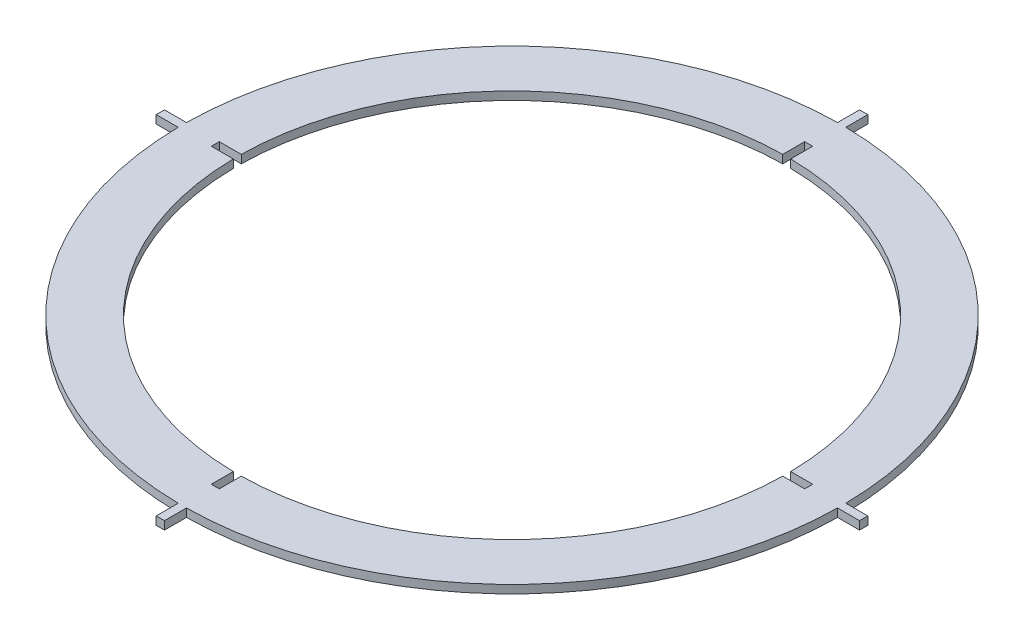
ISO-10303-21;
HEADER;
FILE_DESCRIPTION(('STEP AP214'),'2;1');
FILE_NAME('part.step','',(''),(''),'','','');
FILE_SCHEMA(('AUTOMOTIVE_DESIGN { 1 0 10303 214 1 1 1 1 }'));
ENDSEC;
DATA;
#1=APPLICATION_CONTEXT('core data for automotive mechanical design processes');
#2=APPLICATION_PROTOCOL_DEFINITION('international standard','automotive_design',2000,#1);
#3=PRODUCT_CONTEXT('',#1,'mechanical');
#4=PRODUCT('Part','Part','',(#3));
#5=PRODUCT_RELATED_PRODUCT_CATEGORY('part','',(#4));
#6=PRODUCT_DEFINITION_FORMATION('','',#4);
#7=PRODUCT_DEFINITION_CONTEXT('part definition',#1,'design');
#8=PRODUCT_DEFINITION('design','',#6,#7);
#9=PRODUCT_DEFINITION_SHAPE('','',#8);
#10=(LENGTH_UNIT() NAMED_UNIT(*) SI_UNIT(.MILLI.,.METRE.));
#11=(NAMED_UNIT(*) PLANE_ANGLE_UNIT() SI_UNIT($,.RADIAN.));
#12=(NAMED_UNIT(*) SI_UNIT($,.STERADIAN.) SOLID_ANGLE_UNIT());
#13=UNCERTAINTY_MEASURE_WITH_UNIT(LENGTH_MEASURE(1.E-05),#10,'distance_accuracy_value','');
#14=(GEOMETRIC_REPRESENTATION_CONTEXT(3) GLOBAL_UNCERTAINTY_ASSIGNED_CONTEXT((#13)) GLOBAL_UNIT_ASSIGNED_CONTEXT((#10,
#11,#12)) REPRESENTATION_CONTEXT('',''));
#15=CARTESIAN_POINT('',(0.,0.,0.));
#16=DIRECTION('',(0.,0.,1.));
#17=DIRECTION('',(1.,0.,0.));
#18=AXIS2_PLACEMENT_3D('',#15,#16,#17);
#19=CARTESIAN_POINT('',(0.,3.,-1.50000000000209));
#20=DIRECTION('',(0.,0.,1.));
#21=DIRECTION('',(1.,0.,0.));
#22=AXIS2_PLACEMENT_3D('',#19,#20,#21);
#23=PLANE('',#22);
#24=DIRECTION('',(-1.,0.,0.));
#25=VECTOR('',#24,1.);
#26=CARTESIAN_POINT('',(0.,0.,-1.50000000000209));
#27=LINE('',#26,#25);
#28=CARTESIAN_POINT('',(127.990624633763,0.,-1.50000000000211));
#29=VERTEX_POINT('',#28);
#30=CARTESIAN_POINT('',(119.990624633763,0.,-1.50000000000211));
#31=VERTEX_POINT('',#30);
#32=EDGE_CURVE('E326',#29,#31,#27,.T.);
#33=ORIENTED_EDGE('',*,*,#32,.T.);
#34=DIRECTION('',(0.,-1.,0.));
#35=VECTOR('',#34,1.);
#36=CARTESIAN_POINT('',(119.990624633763,3.,-1.50000000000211));
#37=LINE('',#36,#35);
#38=CARTESIAN_POINT('',(119.990624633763,3.,-1.50000000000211));
#39=VERTEX_POINT('',#38);
#40=EDGE_CURVE('E11',#39,#31,#37,.T.);
#41=ORIENTED_EDGE('',*,*,#40,.F.);
#42=DIRECTION('',(-1.,0.,0.));
#43=VECTOR('',#42,1.);
#44=CARTESIAN_POINT('',(0.,3.,-1.50000000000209));
#45=LINE('',#44,#43);
#46=CARTESIAN_POINT('',(127.990624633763,3.,-1.50000000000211));
#47=VERTEX_POINT('',#46);
#48=EDGE_CURVE('E484',#47,#39,#45,.T.);
#49=ORIENTED_EDGE('',*,*,#48,.F.);
#50=DIRECTION('',(0.,-1.,0.));
#51=VECTOR('',#50,1.);
#52=CARTESIAN_POINT('',(127.990624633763,3.,-1.50000000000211));
#53=LINE('',#52,#51);
#54=EDGE_CURVE('E54',#47,#29,#53,.T.);
#55=ORIENTED_EDGE('',*,*,#54,.T.);
#56=EDGE_LOOP('',(#33,#41,#49,#55));
#57=FACE_BOUND('',#56,.T.);
#58=ADVANCED_FACE('F35',(#57),#23,.F.);
#59=CARTESIAN_POINT('',(0.,3.,0.));
#60=DIRECTION('',(0.,-1.,0.));
#61=DIRECTION('',(0.,0.,-1.));
#62=AXIS2_PLACEMENT_3D('',#59,#60,#61);
#63=CYLINDRICAL_SURFACE('',#62,120.000000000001);
#64=CARTESIAN_POINT('',(0.,0.,0.));
#65=DIRECTION('',(0.,1.,0.));
#66=DIRECTION('',(0.,0.,1.));
#67=AXIS2_PLACEMENT_3D('',#64,#65,#66);
#68=CIRCLE('',#67,120.000000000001);
#69=CARTESIAN_POINT('',(1.50000000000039,0.,-119.99062463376));
#70=VERTEX_POINT('',#69);
#71=EDGE_CURVE('E328',#31,#70,#68,.T.);
#72=ORIENTED_EDGE('',*,*,#71,.T.);
#73=DIRECTION('',(0.,-1.,0.));
#74=VECTOR('',#73,1.);
#75=CARTESIAN_POINT('',(1.50000000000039,3.,-119.99062463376));
#76=LINE('',#75,#74);
#77=CARTESIAN_POINT('',(1.50000000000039,3.,-119.99062463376));
#78=VERTEX_POINT('',#77);
#79=EDGE_CURVE('E45',#78,#70,#76,.T.);
#80=ORIENTED_EDGE('',*,*,#79,.F.);
#81=CARTESIAN_POINT('',(0.,3.,0.));
#82=DIRECTION('',(0.,1.,0.));
#83=DIRECTION('',(0.,0.,1.));
#84=AXIS2_PLACEMENT_3D('',#81,#82,#83);
#85=CIRCLE('',#84,120.000000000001);
#86=EDGE_CURVE('E486',#39,#78,#85,.T.);
#87=ORIENTED_EDGE('',*,*,#86,.F.);
#88=ORIENTED_EDGE('',*,*,#40,.T.);
#89=EDGE_LOOP('',(#72,#80,#87,#88));
#90=FACE_BOUND('',#89,.T.);
#91=ADVANCED_FACE('F535',(#90),#63,.T.);
#92=CARTESIAN_POINT('',(1.49999999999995,3.,0.));
#93=DIRECTION('',(1.,0.,0.));
#94=DIRECTION('',(0.,0.,-1.));
#95=AXIS2_PLACEMENT_3D('',#92,#93,#94);
#96=PLANE('',#95);
#97=DIRECTION('',(0.,0.,1.));
#98=VECTOR('',#97,1.);
#99=CARTESIAN_POINT('',(1.49999999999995,0.,0.));
#100=LINE('',#99,#98);
#101=CARTESIAN_POINT('',(1.50000000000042,0.,-127.99062463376));
#102=VERTEX_POINT('',#101);
#103=EDGE_CURVE('E331',#102,#70,#100,.T.);
#104=ORIENTED_EDGE('',*,*,#103,.F.);
#105=DIRECTION('',(0.,-1.,0.));
#106=VECTOR('',#105,1.);
#107=CARTESIAN_POINT('',(1.50000000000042,3.,-127.99062463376));
#108=LINE('',#107,#106);
#109=CARTESIAN_POINT('',(1.50000000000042,3.,-127.99062463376));
#110=VERTEX_POINT('',#109);
#111=EDGE_CURVE('E391',#110,#102,#108,.T.);
#112=ORIENTED_EDGE('',*,*,#111,.F.);
#113=DIRECTION('',(0.,0.,1.));
#114=VECTOR('',#113,1.);
#115=CARTESIAN_POINT('',(1.49999999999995,3.,0.));
#116=LINE('',#115,#114);
#117=EDGE_CURVE('E488',#110,#78,#116,.T.);
#118=ORIENTED_EDGE('',*,*,#117,.T.);
#119=ORIENTED_EDGE('',*,*,#79,.T.);
#120=EDGE_LOOP('',(#104,#112,#118,#119));
#121=FACE_BOUND('',#120,.T.);
#122=ADVANCED_FACE('F540',(#121),#96,.T.);
#123=CARTESIAN_POINT('',(0.,3.,-127.99062463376));
#124=DIRECTION('',(0.,0.,-1.));
#125=DIRECTION('',(-1.,0.,0.));
#126=AXIS2_PLACEMENT_3D('',#123,#124,#125);
#127=PLANE('',#126);
#128=DIRECTION('',(1.,0.,0.));
#129=VECTOR('',#128,1.);
#130=CARTESIAN_POINT('',(0.,0.,-127.99062463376));
#131=LINE('',#130,#129);
#132=CARTESIAN_POINT('',(-1.49999999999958,0.,-127.99062463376));
#133=VERTEX_POINT('',#132);
#134=EDGE_CURVE('E334',#133,#102,#131,.T.);
#135=ORIENTED_EDGE('',*,*,#134,.F.);
#136=DIRECTION('',(0.,-1.,0.));
#137=VECTOR('',#136,1.);
#138=CARTESIAN_POINT('',(-1.49999999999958,3.,-127.99062463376));
#139=LINE('',#138,#137);
#140=CARTESIAN_POINT('',(-1.49999999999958,3.,-127.99062463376));
#141=VERTEX_POINT('',#140);
#142=EDGE_CURVE('E389',#141,#133,#139,.T.);
#143=ORIENTED_EDGE('',*,*,#142,.F.);
#144=DIRECTION('',(1.,0.,0.));
#145=VECTOR('',#144,1.);
#146=CARTESIAN_POINT('',(0.,3.,-127.99062463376));
#147=LINE('',#146,#145);
#148=EDGE_CURVE('E491',#141,#110,#147,.T.);
#149=ORIENTED_EDGE('',*,*,#148,.T.);
#150=ORIENTED_EDGE('',*,*,#111,.T.);
#151=EDGE_LOOP('',(#135,#143,#149,#150));
#152=FACE_BOUND('',#151,.T.);
#153=ADVANCED_FACE('F851',(#152),#127,.T.);
#154=CARTESIAN_POINT('',(-1.50000000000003,3.,0.));
#155=DIRECTION('',(1.,0.,0.));
#156=DIRECTION('',(0.,0.,-1.));
#157=AXIS2_PLACEMENT_3D('',#154,#155,#156);
#158=PLANE('',#157);
#159=DIRECTION('',(0.,0.,1.));
#160=VECTOR('',#159,1.);
#161=CARTESIAN_POINT('',(-1.50000000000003,0.,0.));
#162=LINE('',#161,#160);
#163=CARTESIAN_POINT('',(-1.49999999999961,0.,-119.99062463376));
#164=VERTEX_POINT('',#163);
#165=EDGE_CURVE('E337',#133,#164,#162,.T.);
#166=ORIENTED_EDGE('',*,*,#165,.T.);
#167=DIRECTION('',(0.,-1.,0.));
#168=VECTOR('',#167,1.);
#169=CARTESIAN_POINT('',(-1.49999999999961,3.,-119.99062463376));
#170=LINE('',#169,#168);
#171=CARTESIAN_POINT('',(-1.49999999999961,3.,-119.99062463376));
#172=VERTEX_POINT('',#171);
#173=EDGE_CURVE('E386',#172,#164,#170,.T.);
#174=ORIENTED_EDGE('',*,*,#173,.F.);
#175=DIRECTION('',(0.,0.,1.));
#176=VECTOR('',#175,1.);
#177=CARTESIAN_POINT('',(-1.50000000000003,3.,0.));
#178=LINE('',#177,#176);
#179=EDGE_CURVE('E494',#141,#172,#178,.T.);
#180=ORIENTED_EDGE('',*,*,#179,.F.);
#181=ORIENTED_EDGE('',*,*,#142,.T.);
#182=EDGE_LOOP('',(#166,#174,#180,#181));
#183=FACE_BOUND('',#182,.T.);
#184=ADVANCED_FACE('F841',(#183),#158,.F.);
#185=CARTESIAN_POINT('',(0.,3.,0.));
#186=DIRECTION('',(0.,-1.,0.));
#187=DIRECTION('',(0.,0.,-1.));
#188=AXIS2_PLACEMENT_3D('',#185,#186,#187);
#189=CYLINDRICAL_SURFACE('',#188,120.);
#190=CARTESIAN_POINT('',(0.,0.,0.));
#191=DIRECTION('',(0.,1.,0.));
#192=DIRECTION('',(0.,0.,1.));
#193=AXIS2_PLACEMENT_3D('',#190,#191,#192);
#194=CIRCLE('',#193,120.);
#195=CARTESIAN_POINT('',(-119.99062463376,0.,-1.49999999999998));
#196=VERTEX_POINT('',#195);
#197=EDGE_CURVE('E339',#164,#196,#194,.T.);
#198=ORIENTED_EDGE('',*,*,#197,.T.);
#199=DIRECTION('',(0.,-1.,0.));
#200=VECTOR('',#199,1.);
#201=CARTESIAN_POINT('',(-119.99062463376,3.,-1.49999999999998));
#202=LINE('',#201,#200);
#203=CARTESIAN_POINT('',(-119.99062463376,3.,-1.49999999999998));
#204=VERTEX_POINT('',#203);
#205=EDGE_CURVE('E384',#204,#196,#202,.T.);
#206=ORIENTED_EDGE('',*,*,#205,.F.);
#207=CARTESIAN_POINT('',(0.,3.,0.));
#208=DIRECTION('',(0.,1.,0.));
#209=DIRECTION('',(0.,0.,1.));
#210=AXIS2_PLACEMENT_3D('',#207,#208,#209);
#211=CIRCLE('',#210,120.);
#212=EDGE_CURVE('E496',#172,#204,#211,.T.);
#213=ORIENTED_EDGE('',*,*,#212,.F.);
#214=ORIENTED_EDGE('',*,*,#173,.T.);
#215=EDGE_LOOP('',(#198,#206,#213,#214));
#216=FACE_BOUND('',#215,.T.);
#217=ADVANCED_FACE('F831',(#216),#189,.T.);
#218=CARTESIAN_POINT('',(0.,3.,-1.49999999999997));
#219=DIRECTION('',(0.,0.,-1.));
#220=DIRECTION('',(-1.,0.,0.));
#221=AXIS2_PLACEMENT_3D('',#218,#219,#220);
#222=PLANE('',#221);
#223=DIRECTION('',(1.,0.,0.));
#224=VECTOR('',#223,1.);
#225=CARTESIAN_POINT('',(0.,0.,-1.49999999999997));
#226=LINE('',#225,#224);
#227=CARTESIAN_POINT('',(-127.99062463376,0.,-1.49999999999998));
#228=VERTEX_POINT('',#227);
#229=EDGE_CURVE('E342',#228,#196,#226,.T.);
#230=ORIENTED_EDGE('',*,*,#229,.F.);
#231=DIRECTION('',(0.,-1.,0.));
#232=VECTOR('',#231,1.);
#233=CARTESIAN_POINT('',(-127.99062463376,3.,-1.49999999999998));
#234=LINE('',#233,#232);
#235=CARTESIAN_POINT('',(-127.99062463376,3.,-1.49999999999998));
#236=VERTEX_POINT('',#235);
#237=EDGE_CURVE('E382',#236,#228,#234,.T.);
#238=ORIENTED_EDGE('',*,*,#237,.F.);
#239=DIRECTION('',(1.,0.,0.));
#240=VECTOR('',#239,1.);
#241=CARTESIAN_POINT('',(0.,3.,-1.49999999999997));
#242=LINE('',#241,#240);
#243=EDGE_CURVE('E498',#236,#204,#242,.T.);
#244=ORIENTED_EDGE('',*,*,#243,.T.);
#245=ORIENTED_EDGE('',*,*,#205,.T.);
#246=EDGE_LOOP('',(#230,#238,#244,#245));
#247=FACE_BOUND('',#246,.T.);
#248=ADVANCED_FACE('F821',(#247),#222,.T.);
#249=CARTESIAN_POINT('',(-127.99062463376,3.,0.));
#250=DIRECTION('',(-1.,0.,0.));
#251=DIRECTION('',(0.,0.,1.));
#252=AXIS2_PLACEMENT_3D('',#249,#250,#251);
#253=PLANE('',#252);
#254=DIRECTION('',(0.,0.,-1.));
#255=VECTOR('',#254,1.);
#256=CARTESIAN_POINT('',(-127.99062463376,0.,0.));
#257=LINE('',#256,#255);
#258=CARTESIAN_POINT('',(-127.99062463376,0.,1.50000000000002));
#259=VERTEX_POINT('',#258);
#260=EDGE_CURVE('E345',#259,#228,#257,.T.);
#261=ORIENTED_EDGE('',*,*,#260,.F.);
#262=DIRECTION('',(0.,-1.,0.));
#263=VECTOR('',#262,1.);
#264=CARTESIAN_POINT('',(-127.99062463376,3.,1.50000000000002));
#265=LINE('',#264,#263);
#266=CARTESIAN_POINT('',(-127.99062463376,3.,1.50000000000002));
#267=VERTEX_POINT('',#266);
#268=EDGE_CURVE('E380',#267,#259,#265,.T.);
#269=ORIENTED_EDGE('',*,*,#268,.F.);
#270=DIRECTION('',(0.,0.,-1.));
#271=VECTOR('',#270,1.);
#272=CARTESIAN_POINT('',(-127.99062463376,3.,0.));
#273=LINE('',#272,#271);
#274=EDGE_CURVE('E501',#267,#236,#273,.T.);
#275=ORIENTED_EDGE('',*,*,#274,.T.);
#276=ORIENTED_EDGE('',*,*,#237,.T.);
#277=EDGE_LOOP('',(#261,#269,#275,#276));
#278=FACE_BOUND('',#277,.T.);
#279=ADVANCED_FACE('F811',(#278),#253,.T.);
#280=CARTESIAN_POINT('',(0.,3.,1.50000000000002));
#281=DIRECTION('',(0.,0.,-1.));
#282=DIRECTION('',(-1.,0.,0.));
#283=AXIS2_PLACEMENT_3D('',#280,#281,#282);
#284=PLANE('',#283);
#285=DIRECTION('',(1.,0.,0.));
#286=VECTOR('',#285,1.);
#287=CARTESIAN_POINT('',(0.,0.,1.50000000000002));
#288=LINE('',#287,#286);
#289=CARTESIAN_POINT('',(-119.99062463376,0.,1.50000000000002));
#290=VERTEX_POINT('',#289);
#291=EDGE_CURVE('E348',#259,#290,#288,.T.);
#292=ORIENTED_EDGE('',*,*,#291,.T.);
#293=DIRECTION('',(0.,-1.,0.));
#294=VECTOR('',#293,1.);
#295=CARTESIAN_POINT('',(-119.99062463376,3.,1.50000000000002));
#296=LINE('',#295,#294);
#297=CARTESIAN_POINT('',(-119.99062463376,3.,1.50000000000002));
#298=VERTEX_POINT('',#297);
#299=EDGE_CURVE('E377',#298,#290,#296,.T.);
#300=ORIENTED_EDGE('',*,*,#299,.F.);
#301=DIRECTION('',(1.,0.,0.));
#302=VECTOR('',#301,1.);
#303=CARTESIAN_POINT('',(0.,3.,1.50000000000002));
#304=LINE('',#303,#302);
#305=EDGE_CURVE('E504',#267,#298,#304,.T.);
#306=ORIENTED_EDGE('',*,*,#305,.F.);
#307=ORIENTED_EDGE('',*,*,#268,.T.);
#308=EDGE_LOOP('',(#292,#300,#306,#307));
#309=FACE_BOUND('',#308,.T.);
#310=ADVANCED_FACE('F801',(#309),#284,.F.);
#311=CARTESIAN_POINT('',(0.,3.,0.));
#312=DIRECTION('',(0.,-1.,0.));
#313=DIRECTION('',(0.,0.,-1.));
#314=AXIS2_PLACEMENT_3D('',#311,#312,#313);
#315=CYLINDRICAL_SURFACE('',#314,120.);
#316=CARTESIAN_POINT('',(0.,0.,0.));
#317=DIRECTION('',(0.,1.,0.));
#318=DIRECTION('',(0.,0.,1.));
#319=AXIS2_PLACEMENT_3D('',#316,#317,#318);
#320=CIRCLE('',#319,120.);
#321=CARTESIAN_POINT('',(-1.49999999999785,0.,119.99062463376));
#322=VERTEX_POINT('',#321);
#323=EDGE_CURVE('E350',#290,#322,#320,.T.);
#324=ORIENTED_EDGE('',*,*,#323,.T.);
#325=DIRECTION('',(0.,-1.,0.));
#326=VECTOR('',#325,1.);
#327=CARTESIAN_POINT('',(-1.49999999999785,3.,119.99062463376));
#328=LINE('',#327,#326);
#329=CARTESIAN_POINT('',(-1.49999999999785,3.,119.99062463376));
#330=VERTEX_POINT('',#329);
#331=EDGE_CURVE('E375',#330,#322,#328,.T.);
#332=ORIENTED_EDGE('',*,*,#331,.F.);
#333=CARTESIAN_POINT('',(0.,3.,0.));
#334=DIRECTION('',(0.,1.,0.));
#335=DIRECTION('',(0.,0.,1.));
#336=AXIS2_PLACEMENT_3D('',#333,#334,#335);
#337=CIRCLE('',#336,120.);
#338=EDGE_CURVE('E506',#298,#330,#337,.T.);
#339=ORIENTED_EDGE('',*,*,#338,.F.);
#340=ORIENTED_EDGE('',*,*,#299,.T.);
#341=EDGE_LOOP('',(#324,#332,#339,#340));
#342=FACE_BOUND('',#341,.T.);
#343=ADVANCED_FACE('F791',(#342),#315,.T.);
#344=CARTESIAN_POINT('',(-1.49999999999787,3.,0.));
#345=DIRECTION('',(-1.,0.,0.));
#346=DIRECTION('',(0.,0.,1.));
#347=AXIS2_PLACEMENT_3D('',#344,#345,#346);
#348=PLANE('',#347);
#349=DIRECTION('',(0.,0.,-1.));
#350=VECTOR('',#349,1.);
#351=CARTESIAN_POINT('',(-1.49999999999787,0.,0.));
#352=LINE('',#351,#350);
#353=CARTESIAN_POINT('',(-1.49999999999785,0.,127.99062463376));
#354=VERTEX_POINT('',#353);
#355=EDGE_CURVE('E353',#354,#322,#352,.T.);
#356=ORIENTED_EDGE('',*,*,#355,.F.);
#357=DIRECTION('',(0.,-1.,0.));
#358=VECTOR('',#357,1.);
#359=CARTESIAN_POINT('',(-1.49999999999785,3.,127.99062463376));
#360=LINE('',#359,#358);
#361=CARTESIAN_POINT('',(-1.49999999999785,3.,127.99062463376));
#362=VERTEX_POINT('',#361);
#363=EDGE_CURVE('E373',#362,#354,#360,.T.);
#364=ORIENTED_EDGE('',*,*,#363,.F.);
#365=DIRECTION('',(0.,0.,-1.));
#366=VECTOR('',#365,1.);
#367=CARTESIAN_POINT('',(-1.49999999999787,3.,0.));
#368=LINE('',#367,#366);
#369=EDGE_CURVE('E508',#362,#330,#368,.T.);
#370=ORIENTED_EDGE('',*,*,#369,.T.);
#371=ORIENTED_EDGE('',*,*,#331,.T.);
#372=EDGE_LOOP('',(#356,#364,#370,#371));
#373=FACE_BOUND('',#372,.T.);
#374=ADVANCED_FACE('F521',(#373),#348,.T.);
#375=CARTESIAN_POINT('',(-1.18415115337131E-12,3.,127.99062463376));
#376=DIRECTION('',(0.,0.,1.));
#377=DIRECTION('',(1.,0.,0.));
#378=AXIS2_PLACEMENT_3D('',#375,#376,#377);
#379=PLANE('',#378);
#380=DIRECTION('',(-1.,0.,0.));
#381=VECTOR('',#380,1.);
#382=CARTESIAN_POINT('',(-1.18415115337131E-12,0.,127.99062463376));
#383=LINE('',#382,#381);
#384=CARTESIAN_POINT('',(1.50000000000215,0.,127.99062463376));
#385=VERTEX_POINT('',#384);
#386=EDGE_CURVE('E356',#385,#354,#383,.T.);
#387=ORIENTED_EDGE('',*,*,#386,.F.);
#388=DIRECTION('',(0.,-1.,0.));
#389=VECTOR('',#388,1.);
#390=CARTESIAN_POINT('',(1.50000000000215,3.,127.99062463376));
#391=LINE('',#390,#389);
#392=CARTESIAN_POINT('',(1.50000000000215,3.,127.99062463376));
#393=VERTEX_POINT('',#392);
#394=EDGE_CURVE('E371',#393,#385,#391,.T.);
#395=ORIENTED_EDGE('',*,*,#394,.F.);
#396=DIRECTION('',(-1.,0.,0.));
#397=VECTOR('',#396,1.);
#398=CARTESIAN_POINT('',(-1.18415115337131E-12,3.,127.99062463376));
#399=LINE('',#398,#397);
#400=EDGE_CURVE('E511',#393,#362,#399,.T.);
#401=ORIENTED_EDGE('',*,*,#400,.T.);
#402=ORIENTED_EDGE('',*,*,#363,.T.);
#403=EDGE_LOOP('',(#387,#395,#401,#402));
#404=FACE_BOUND('',#403,.T.);
#405=ADVANCED_FACE('F515',(#404),#379,.T.);
#406=CARTESIAN_POINT('',(1.50000000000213,3.,0.));
#407=DIRECTION('',(-1.,0.,0.));
#408=DIRECTION('',(0.,0.,1.));
#409=AXIS2_PLACEMENT_3D('',#406,#407,#408);
#410=PLANE('',#409);
#411=DIRECTION('',(0.,0.,-1.));
#412=VECTOR('',#411,1.);
#413=CARTESIAN_POINT('',(1.50000000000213,0.,0.));
#414=LINE('',#413,#412);
#415=CARTESIAN_POINT('',(1.50000000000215,0.,119.99062463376));
#416=VERTEX_POINT('',#415);
#417=EDGE_CURVE('E359',#385,#416,#414,.T.);
#418=ORIENTED_EDGE('',*,*,#417,.T.);
#419=DIRECTION('',(0.,-1.,0.));
#420=VECTOR('',#419,1.);
#421=CARTESIAN_POINT('',(1.50000000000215,3.,119.99062463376));
#422=LINE('',#421,#420);
#423=CARTESIAN_POINT('',(1.50000000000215,3.,119.99062463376));
#424=VERTEX_POINT('',#423);
#425=EDGE_CURVE('E273',#424,#416,#422,.T.);
#426=ORIENTED_EDGE('',*,*,#425,.F.);
#427=DIRECTION('',(0.,0.,-1.));
#428=VECTOR('',#427,1.);
#429=CARTESIAN_POINT('',(1.50000000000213,3.,0.));
#430=LINE('',#429,#428);
#431=EDGE_CURVE('E261',#393,#424,#430,.T.);
#432=ORIENTED_EDGE('',*,*,#431,.F.);
#433=ORIENTED_EDGE('',*,*,#394,.T.);
#434=EDGE_LOOP('',(#418,#426,#432,#433));
#435=FACE_BOUND('',#434,.T.);
#436=ADVANCED_FACE('F525',(#435),#410,.F.);
#437=CARTESIAN_POINT('',(0.,3.,0.));
#438=DIRECTION('',(0.,-1.,0.));
#439=DIRECTION('',(0.,0.,-1.));
#440=AXIS2_PLACEMENT_3D('',#437,#438,#439);
#441=CYLINDRICAL_SURFACE('',#440,120.000000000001);
#442=CARTESIAN_POINT('',(0.,0.,0.));
#443=DIRECTION('',(0.,1.,0.));
#444=DIRECTION('',(0.,0.,1.));
#445=AXIS2_PLACEMENT_3D('',#442,#443,#444);
#446=CIRCLE('',#445,120.000000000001);
#447=CARTESIAN_POINT('',(119.990624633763,0.,1.4999999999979));
#448=VERTEX_POINT('',#447);
#449=EDGE_CURVE('E270',#416,#448,#446,.T.);
#450=ORIENTED_EDGE('',*,*,#449,.T.);
#451=DIRECTION('',(0.,-1.,0.));
#452=VECTOR('',#451,1.);
#453=CARTESIAN_POINT('',(119.990624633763,3.,1.4999999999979));
#454=LINE('',#453,#452);
#455=CARTESIAN_POINT('',(119.990624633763,3.,1.4999999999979));
#456=VERTEX_POINT('',#455);
#457=EDGE_CURVE('E267',#456,#448,#454,.T.);
#458=ORIENTED_EDGE('',*,*,#457,.F.);
#459=CARTESIAN_POINT('',(0.,3.,0.));
#460=DIRECTION('',(0.,1.,0.));
#461=DIRECTION('',(0.,0.,1.));
#462=AXIS2_PLACEMENT_3D('',#459,#460,#461);
#463=CIRCLE('',#462,120.000000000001);
#464=EDGE_CURVE('E252',#424,#456,#463,.T.);
#465=ORIENTED_EDGE('',*,*,#464,.F.);
#466=ORIENTED_EDGE('',*,*,#425,.T.);
#467=EDGE_LOOP('',(#450,#458,#465,#466));
#468=FACE_BOUND('',#467,.T.);
#469=ADVANCED_FACE('F268',(#468),#441,.T.);
#470=CARTESIAN_POINT('',(0.,3.,1.49999999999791));
#471=DIRECTION('',(0.,0.,1.));
#472=DIRECTION('',(1.,0.,0.));
#473=AXIS2_PLACEMENT_3D('',#470,#471,#472);
#474=PLANE('',#473);
#475=DIRECTION('',(-1.,0.,0.));
#476=VECTOR('',#475,1.);
#477=CARTESIAN_POINT('',(0.,0.,1.49999999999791));
#478=LINE('',#477,#476);
#479=CARTESIAN_POINT('',(127.990624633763,0.,1.49999999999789));
#480=VERTEX_POINT('',#479);
#481=EDGE_CURVE('E362',#480,#448,#478,.T.);
#482=ORIENTED_EDGE('',*,*,#481,.F.);
#483=DIRECTION('',(0.,-1.,0.));
#484=VECTOR('',#483,1.);
#485=CARTESIAN_POINT('',(127.990624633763,3.,1.49999999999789));
#486=LINE('',#485,#484);
#487=CARTESIAN_POINT('',(127.990624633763,3.,1.49999999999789));
#488=VERTEX_POINT('',#487);
#489=EDGE_CURVE('E152',#488,#480,#486,.T.);
#490=ORIENTED_EDGE('',*,*,#489,.F.);
#491=DIRECTION('',(-1.,0.,0.));
#492=VECTOR('',#491,1.);
#493=CARTESIAN_POINT('',(0.,3.,1.49999999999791));
#494=LINE('',#493,#492);
#495=EDGE_CURVE('E258',#488,#456,#494,.T.);
#496=ORIENTED_EDGE('',*,*,#495,.T.);
#497=ORIENTED_EDGE('',*,*,#457,.T.);
#498=EDGE_LOOP('',(#482,#490,#496,#497));
#499=FACE_BOUND('',#498,.T.);
#500=ADVANCED_FACE('F275',(#499),#474,.T.);
#501=CARTESIAN_POINT('',(0.,3.,0.));
#502=DIRECTION('',(0.,-1.,0.));
#503=DIRECTION('',(0.,0.,-1.));
#504=AXIS2_PLACEMENT_3D('',#501,#502,#503);
#505=CYLINDRICAL_SURFACE('',#504,100.);
#506=CARTESIAN_POINT('',(0.,0.,0.));
#507=DIRECTION('',(0.,1.,0.));
#508=DIRECTION('',(0.,0.,1.));
#509=AXIS2_PLACEMENT_3D('',#506,#507,#508);
#510=CIRCLE('',#509,100.);
#511=CARTESIAN_POINT('',(99.9894869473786,0.,-1.45));
#512=VERTEX_POINT('',#511);
#513=CARTESIAN_POINT('',(1.45,0.,-99.9894869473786));
#514=VERTEX_POINT('',#513);
#515=EDGE_CURVE('E282',#512,#514,#510,.T.);
#516=ORIENTED_EDGE('',*,*,#515,.F.);
#517=DIRECTION('',(0.,-1.,0.));
#518=VECTOR('',#517,1.);
#519=CARTESIAN_POINT('',(99.9894869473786,3.,-1.45));
#520=LINE('',#519,#518);
#521=CARTESIAN_POINT('',(99.9894869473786,3.,-1.45));
#522=VERTEX_POINT('',#521);
#523=EDGE_CURVE('E39',#522,#512,#520,.T.);
#524=ORIENTED_EDGE('',*,*,#523,.F.);
#525=CARTESIAN_POINT('',(0.,3.,0.));
#526=DIRECTION('',(0.,1.,0.));
#527=DIRECTION('',(0.,0.,1.));
#528=AXIS2_PLACEMENT_3D('',#525,#526,#527);
#529=CIRCLE('',#528,100.);
#530=CARTESIAN_POINT('',(1.45,3.,-99.9894869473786));
#531=VERTEX_POINT('',#530);
#532=EDGE_CURVE('E367',#522,#531,#529,.T.);
#533=ORIENTED_EDGE('',*,*,#532,.T.);
#534=DIRECTION('',(0.,-1.,0.));
#535=VECTOR('',#534,1.);
#536=CARTESIAN_POINT('',(1.45,3.,-99.9894869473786));
#537=LINE('',#536,#535);
#538=EDGE_CURVE('E278',#531,#514,#537,.T.);
#539=ORIENTED_EDGE('',*,*,#538,.T.);
#540=EDGE_LOOP('',(#516,#524,#533,#539));
#541=FACE_BOUND('',#540,.T.);
#542=ADVANCED_FACE('F37',(#541),#505,.F.);
#543=CARTESIAN_POINT('',(0.,3.,-1.44999999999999));
#544=DIRECTION('',(0.,0.,1.));
#545=DIRECTION('',(1.,0.,0.));
#546=AXIS2_PLACEMENT_3D('',#543,#544,#545);
#547=PLANE('',#546);
#548=DIRECTION('',(-1.,0.,0.));
#549=VECTOR('',#548,1.);
#550=CARTESIAN_POINT('',(0.,0.,-1.44999999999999));
#551=LINE('',#550,#549);
#552=CARTESIAN_POINT('',(107.989486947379,0.,-1.45));
#553=VERTEX_POINT('',#552);
#554=EDGE_CURVE('E285',#553,#512,#551,.T.);
#555=ORIENTED_EDGE('',*,*,#554,.F.);
#556=DIRECTION('',(0.,-1.,0.));
#557=VECTOR('',#556,1.);
#558=CARTESIAN_POINT('',(107.989486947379,3.,-1.45));
#559=LINE('',#558,#557);
#560=CARTESIAN_POINT('',(107.989486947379,3.,-1.45));
#561=VERTEX_POINT('',#560);
#562=EDGE_CURVE('E424',#561,#553,#559,.T.);
#563=ORIENTED_EDGE('',*,*,#562,.F.);
#564=DIRECTION('',(-1.,0.,0.));
#565=VECTOR('',#564,1.);
#566=CARTESIAN_POINT('',(0.,3.,-1.44999999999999));
#567=LINE('',#566,#565);
#568=EDGE_CURVE('E433',#561,#522,#567,.T.);
#569=ORIENTED_EDGE('',*,*,#568,.T.);
#570=ORIENTED_EDGE('',*,*,#523,.T.);
#571=EDGE_LOOP('',(#555,#563,#569,#570));
#572=FACE_BOUND('',#571,.T.);
#573=ADVANCED_FACE('F431',(#572),#547,.T.);
#574=CARTESIAN_POINT('',(107.989486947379,3.,5.16777650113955E-13));
#575=DIRECTION('',(1.,0.,0.));
#576=DIRECTION('',(0.,0.,-1.));
#577=AXIS2_PLACEMENT_3D('',#574,#575,#576);
#578=PLANE('',#577);
#579=DIRECTION('',(0.,0.,1.));
#580=VECTOR('',#579,1.);
#581=CARTESIAN_POINT('',(107.989486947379,0.,5.16777650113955E-13));
#582=LINE('',#581,#580);
#583=CARTESIAN_POINT('',(107.989486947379,0.,1.45));
#584=VERTEX_POINT('',#583);
#585=EDGE_CURVE('E288',#553,#584,#582,.T.);
#586=ORIENTED_EDGE('',*,*,#585,.T.);
#587=DIRECTION('',(0.,-1.,0.));
#588=VECTOR('',#587,1.);
#589=CARTESIAN_POINT('',(107.989486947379,3.,1.45));
#590=LINE('',#589,#588);
#591=CARTESIAN_POINT('',(107.989486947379,3.,1.45));
#592=VERTEX_POINT('',#591);
#593=EDGE_CURVE('E422',#592,#584,#590,.T.);
#594=ORIENTED_EDGE('',*,*,#593,.F.);
#595=DIRECTION('',(0.,0.,1.));
#596=VECTOR('',#595,1.);
#597=CARTESIAN_POINT('',(107.989486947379,3.,5.16777650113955E-13));
#598=LINE('',#597,#596);
#599=EDGE_CURVE('E451',#561,#592,#598,.T.);
#600=ORIENTED_EDGE('',*,*,#599,.F.);
#601=ORIENTED_EDGE('',*,*,#562,.T.);
#602=EDGE_LOOP('',(#586,#594,#600,#601));
#603=FACE_BOUND('',#602,.T.);
#604=ADVANCED_FACE('F441',(#603),#578,.F.);
#605=CARTESIAN_POINT('',(0.,3.,1.44999999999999));
#606=DIRECTION('',(0.,0.,1.));
#607=DIRECTION('',(1.,0.,0.));
#608=AXIS2_PLACEMENT_3D('',#605,#606,#607);
#609=PLANE('',#608);
#610=DIRECTION('',(-1.,0.,0.));
#611=VECTOR('',#610,1.);
#612=CARTESIAN_POINT('',(0.,0.,1.44999999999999));
#613=LINE('',#612,#611);
#614=CARTESIAN_POINT('',(99.9894869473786,0.,1.45));
#615=VERTEX_POINT('',#614);
#616=EDGE_CURVE('E290',#584,#615,#613,.T.);
#617=ORIENTED_EDGE('',*,*,#616,.T.);
#618=DIRECTION('',(0.,-1.,0.));
#619=VECTOR('',#618,1.);
#620=CARTESIAN_POINT('',(99.9894869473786,3.,1.45));
#621=LINE('',#620,#619);
#622=CARTESIAN_POINT('',(99.9894869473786,3.,1.45));
#623=VERTEX_POINT('',#622);
#624=EDGE_CURVE('E420',#623,#615,#621,.T.);
#625=ORIENTED_EDGE('',*,*,#624,.F.);
#626=DIRECTION('',(-1.,0.,0.));
#627=VECTOR('',#626,1.);
#628=CARTESIAN_POINT('',(0.,3.,1.44999999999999));
#629=LINE('',#628,#627);
#630=EDGE_CURVE('E446',#592,#623,#629,.T.);
#631=ORIENTED_EDGE('',*,*,#630,.F.);
#632=ORIENTED_EDGE('',*,*,#593,.T.);
#633=EDGE_LOOP('',(#617,#625,#631,#632));
#634=FACE_BOUND('',#633,.T.);
#635=ADVANCED_FACE('F444',(#634),#609,.F.);
#636=CARTESIAN_POINT('',(0.,3.,0.));
#637=DIRECTION('',(0.,-1.,0.));
#638=DIRECTION('',(0.,0.,-1.));
#639=AXIS2_PLACEMENT_3D('',#636,#637,#638);
#640=CYLINDRICAL_SURFACE('',#639,100.);
#641=CARTESIAN_POINT('',(0.,0.,0.));
#642=DIRECTION('',(0.,1.,0.));
#643=DIRECTION('',(0.,0.,1.));
#644=AXIS2_PLACEMENT_3D('',#641,#642,#643);
#645=CIRCLE('',#644,100.);
#646=CARTESIAN_POINT('',(1.45,0.,99.9894869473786));
#647=VERTEX_POINT('',#646);
#648=EDGE_CURVE('E293',#647,#615,#645,.T.);
#649=ORIENTED_EDGE('',*,*,#648,.F.);
#650=DIRECTION('',(0.,-1.,0.));
#651=VECTOR('',#650,1.);
#652=CARTESIAN_POINT('',(1.45,3.,99.9894869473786));
#653=LINE('',#652,#651);
#654=CARTESIAN_POINT('',(1.45,3.,99.9894869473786));
#655=VERTEX_POINT('',#654);
#656=EDGE_CURVE('E418',#655,#647,#653,.T.);
#657=ORIENTED_EDGE('',*,*,#656,.F.);
#658=CARTESIAN_POINT('',(0.,3.,0.));
#659=DIRECTION('',(0.,1.,0.));
#660=DIRECTION('',(0.,0.,1.));
#661=AXIS2_PLACEMENT_3D('',#658,#659,#660);
#662=CIRCLE('',#661,100.);
#663=EDGE_CURVE('E450',#655,#623,#662,.T.);
#664=ORIENTED_EDGE('',*,*,#663,.T.);
#665=ORIENTED_EDGE('',*,*,#624,.T.);
#666=EDGE_LOOP('',(#649,#657,#664,#665));
#667=FACE_BOUND('',#666,.T.);
#668=ADVANCED_FACE('F589',(#667),#640,.F.);
#669=CARTESIAN_POINT('',(1.44999999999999,3.,0.));
#670=DIRECTION('',(-1.,0.,0.));
#671=DIRECTION('',(0.,0.,1.));
#672=AXIS2_PLACEMENT_3D('',#669,#670,#671);
#673=PLANE('',#672);
#674=DIRECTION('',(0.,0.,-1.));
#675=VECTOR('',#674,1.);
#676=CARTESIAN_POINT('',(1.44999999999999,0.,0.));
#677=LINE('',#676,#675);
#678=CARTESIAN_POINT('',(1.45000000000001,0.,107.989486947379));
#679=VERTEX_POINT('',#678);
#680=EDGE_CURVE('E296',#679,#647,#677,.T.);
#681=ORIENTED_EDGE('',*,*,#680,.F.);
#682=DIRECTION('',(0.,-1.,0.));
#683=VECTOR('',#682,1.);
#684=CARTESIAN_POINT('',(1.45000000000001,3.,107.989486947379));
#685=LINE('',#684,#683);
#686=CARTESIAN_POINT('',(1.45000000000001,3.,107.989486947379));
#687=VERTEX_POINT('',#686);
#688=EDGE_CURVE('E416',#687,#679,#685,.T.);
#689=ORIENTED_EDGE('',*,*,#688,.F.);
#690=DIRECTION('',(0.,0.,-1.));
#691=VECTOR('',#690,1.);
#692=CARTESIAN_POINT('',(1.44999999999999,3.,0.));
#693=LINE('',#692,#691);
#694=EDGE_CURVE('E453',#687,#655,#693,.T.);
#695=ORIENTED_EDGE('',*,*,#694,.T.);
#696=ORIENTED_EDGE('',*,*,#656,.T.);
#697=EDGE_LOOP('',(#681,#689,#695,#696));
#698=FACE_BOUND('',#697,.T.);
#699=ADVANCED_FACE('F585',(#698),#673,.T.);
#700=CARTESIAN_POINT('',(-5.16777650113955E-13,3.,107.989486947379));
#701=DIRECTION('',(0.,0.,1.));
#702=DIRECTION('',(1.,0.,0.));
#703=AXIS2_PLACEMENT_3D('',#700,#701,#702);
#704=PLANE('',#703);
#705=DIRECTION('',(-1.,0.,0.));
#706=VECTOR('',#705,1.);
#707=CARTESIAN_POINT('',(-5.16777650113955E-13,0.,107.989486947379));
#708=LINE('',#707,#706);
#709=CARTESIAN_POINT('',(-1.44999999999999,0.,107.989486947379));
#710=VERTEX_POINT('',#709);
#711=EDGE_CURVE('E299',#679,#710,#708,.T.);
#712=ORIENTED_EDGE('',*,*,#711,.T.);
#713=DIRECTION('',(0.,-1.,0.));
#714=VECTOR('',#713,1.);
#715=CARTESIAN_POINT('',(-1.44999999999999,3.,107.989486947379));
#716=LINE('',#715,#714);
#717=CARTESIAN_POINT('',(-1.44999999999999,3.,107.989486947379));
#718=VERTEX_POINT('',#717);
#719=EDGE_CURVE('E413',#718,#710,#716,.T.);
#720=ORIENTED_EDGE('',*,*,#719,.F.);
#721=DIRECTION('',(-1.,0.,0.));
#722=VECTOR('',#721,1.);
#723=CARTESIAN_POINT('',(-5.16777650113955E-13,3.,107.989486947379));
#724=LINE('',#723,#722);
#725=EDGE_CURVE('E460',#687,#718,#724,.T.);
#726=ORIENTED_EDGE('',*,*,#725,.F.);
#727=ORIENTED_EDGE('',*,*,#688,.T.);
#728=EDGE_LOOP('',(#712,#720,#726,#727));
#729=FACE_BOUND('',#728,.T.);
#730=ADVANCED_FACE('F581',(#729),#704,.F.);
#731=CARTESIAN_POINT('',(-1.44999999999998,3.,0.));
#732=DIRECTION('',(-1.,0.,0.));
#733=DIRECTION('',(0.,0.,1.));
#734=AXIS2_PLACEMENT_3D('',#731,#732,#733);
#735=PLANE('',#734);
#736=DIRECTION('',(0.,0.,-1.));
#737=VECTOR('',#736,1.);
#738=CARTESIAN_POINT('',(-1.44999999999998,0.,0.));
#739=LINE('',#738,#737);
#740=CARTESIAN_POINT('',(-1.44999999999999,0.,99.9894869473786));
#741=VERTEX_POINT('',#740);
#742=EDGE_CURVE('E301',#710,#741,#739,.T.);
#743=ORIENTED_EDGE('',*,*,#742,.T.);
#744=DIRECTION('',(0.,-1.,0.));
#745=VECTOR('',#744,1.);
#746=CARTESIAN_POINT('',(-1.44999999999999,3.,99.9894869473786));
#747=LINE('',#746,#745);
#748=CARTESIAN_POINT('',(-1.44999999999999,3.,99.9894869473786));
#749=VERTEX_POINT('',#748);
#750=EDGE_CURVE('E411',#749,#741,#747,.T.);
#751=ORIENTED_EDGE('',*,*,#750,.F.);
#752=DIRECTION('',(0.,0.,-1.));
#753=VECTOR('',#752,1.);
#754=CARTESIAN_POINT('',(-1.44999999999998,3.,0.));
#755=LINE('',#754,#753);
#756=EDGE_CURVE('E462',#718,#749,#755,.T.);
#757=ORIENTED_EDGE('',*,*,#756,.F.);
#758=ORIENTED_EDGE('',*,*,#719,.T.);
#759=EDGE_LOOP('',(#743,#751,#757,#758));
#760=FACE_BOUND('',#759,.T.);
#761=ADVANCED_FACE('F577',(#760),#735,.F.);
#762=CARTESIAN_POINT('',(0.,3.,0.));
#763=DIRECTION('',(0.,-1.,0.));
#764=DIRECTION('',(0.,0.,-1.));
#765=AXIS2_PLACEMENT_3D('',#762,#763,#764);
#766=CYLINDRICAL_SURFACE('',#765,100.);
#767=CARTESIAN_POINT('',(0.,0.,0.));
#768=DIRECTION('',(0.,1.,0.));
#769=DIRECTION('',(0.,0.,1.));
#770=AXIS2_PLACEMENT_3D('',#767,#768,#769);
#771=CIRCLE('',#770,100.);
#772=CARTESIAN_POINT('',(-99.9894869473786,0.,1.44999999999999));
#773=VERTEX_POINT('',#772);
#774=EDGE_CURVE('E304',#773,#741,#771,.T.);
#775=ORIENTED_EDGE('',*,*,#774,.F.);
#776=DIRECTION('',(0.,-1.,0.));
#777=VECTOR('',#776,1.);
#778=CARTESIAN_POINT('',(-99.9894869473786,3.,1.44999999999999));
#779=LINE('',#778,#777);
#780=CARTESIAN_POINT('',(-99.9894869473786,3.,1.44999999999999));
#781=VERTEX_POINT('',#780);
#782=EDGE_CURVE('E409',#781,#773,#779,.T.);
#783=ORIENTED_EDGE('',*,*,#782,.F.);
#784=CARTESIAN_POINT('',(0.,3.,0.));
#785=DIRECTION('',(0.,1.,0.));
#786=DIRECTION('',(0.,0.,1.));
#787=AXIS2_PLACEMENT_3D('',#784,#785,#786);
#788=CIRCLE('',#787,100.);
#789=EDGE_CURVE('E464',#781,#749,#788,.T.);
#790=ORIENTED_EDGE('',*,*,#789,.T.);
#791=ORIENTED_EDGE('',*,*,#750,.T.);
#792=EDGE_LOOP('',(#775,#783,#790,#791));
#793=FACE_BOUND('',#792,.T.);
#794=ADVANCED_FACE('F573',(#793),#766,.F.);
#795=CARTESIAN_POINT('',(0.,3.,1.44999999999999));
#796=DIRECTION('',(0.,0.,-1.));
#797=DIRECTION('',(-1.,0.,0.));
#798=AXIS2_PLACEMENT_3D('',#795,#796,#797);
#799=PLANE('',#798);
#800=DIRECTION('',(1.,0.,0.));
#801=VECTOR('',#800,1.);
#802=CARTESIAN_POINT('',(0.,0.,1.44999999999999));
#803=LINE('',#802,#801);
#804=CARTESIAN_POINT('',(-107.989486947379,0.,1.44999999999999));
#805=VERTEX_POINT('',#804);
#806=EDGE_CURVE('E307',#805,#773,#803,.T.);
#807=ORIENTED_EDGE('',*,*,#806,.F.);
#808=DIRECTION('',(0.,-1.,0.));
#809=VECTOR('',#808,1.);
#810=CARTESIAN_POINT('',(-107.989486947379,3.,1.44999999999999));
#811=LINE('',#810,#809);
#812=CARTESIAN_POINT('',(-107.989486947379,3.,1.44999999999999));
#813=VERTEX_POINT('',#812);
#814=EDGE_CURVE('E407',#813,#805,#811,.T.);
#815=ORIENTED_EDGE('',*,*,#814,.F.);
#816=DIRECTION('',(1.,0.,0.));
#817=VECTOR('',#816,1.);
#818=CARTESIAN_POINT('',(0.,3.,1.44999999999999));
#819=LINE('',#818,#817);
#820=EDGE_CURVE('E467',#813,#781,#819,.T.);
#821=ORIENTED_EDGE('',*,*,#820,.T.);
#822=ORIENTED_EDGE('',*,*,#782,.T.);
#823=EDGE_LOOP('',(#807,#815,#821,#822));
#824=FACE_BOUND('',#823,.T.);
#825=ADVANCED_FACE('F569',(#824),#799,.T.);
#826=CARTESIAN_POINT('',(-107.989486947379,3.,-5.16777650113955E-13));
#827=DIRECTION('',(-1.,0.,0.));
#828=DIRECTION('',(0.,0.,1.));
#829=AXIS2_PLACEMENT_3D('',#826,#827,#828);
#830=PLANE('',#829);
#831=DIRECTION('',(0.,0.,-1.));
#832=VECTOR('',#831,1.);
#833=CARTESIAN_POINT('',(-107.989486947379,0.,-5.16777650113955E-13));
#834=LINE('',#833,#832);
#835=CARTESIAN_POINT('',(-107.989486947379,0.,-1.45000000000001));
#836=VERTEX_POINT('',#835);
#837=EDGE_CURVE('E310',#805,#836,#834,.T.);
#838=ORIENTED_EDGE('',*,*,#837,.T.);
#839=DIRECTION('',(0.,-1.,0.));
#840=VECTOR('',#839,1.);
#841=CARTESIAN_POINT('',(-107.989486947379,3.,-1.45000000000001));
#842=LINE('',#841,#840);
#843=CARTESIAN_POINT('',(-107.989486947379,3.,-1.45000000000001));
#844=VERTEX_POINT('',#843);
#845=EDGE_CURVE('E404',#844,#836,#842,.T.);
#846=ORIENTED_EDGE('',*,*,#845,.F.);
#847=DIRECTION('',(0.,0.,-1.));
#848=VECTOR('',#847,1.);
#849=CARTESIAN_POINT('',(-107.989486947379,3.,-5.16777650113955E-13));
#850=LINE('',#849,#848);
#851=EDGE_CURVE('E470',#813,#844,#850,.T.);
#852=ORIENTED_EDGE('',*,*,#851,.F.);
#853=ORIENTED_EDGE('',*,*,#814,.T.);
#854=EDGE_LOOP('',(#838,#846,#852,#853));
#855=FACE_BOUND('',#854,.T.);
#856=ADVANCED_FACE('F565',(#855),#830,.F.);
#857=CARTESIAN_POINT('',(0.,3.,-1.44999999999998));
#858=DIRECTION('',(0.,0.,-1.));
#859=DIRECTION('',(-1.,0.,0.));
#860=AXIS2_PLACEMENT_3D('',#857,#858,#859);
#861=PLANE('',#860);
#862=DIRECTION('',(1.,0.,0.));
#863=VECTOR('',#862,1.);
#864=CARTESIAN_POINT('',(0.,0.,-1.44999999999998));
#865=LINE('',#864,#863);
#866=CARTESIAN_POINT('',(-99.9894869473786,0.,-1.45000000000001));
#867=VERTEX_POINT('',#866);
#868=EDGE_CURVE('E312',#836,#867,#865,.T.);
#869=ORIENTED_EDGE('',*,*,#868,.T.);
#870=DIRECTION('',(0.,-1.,0.));
#871=VECTOR('',#870,1.);
#872=CARTESIAN_POINT('',(-99.9894869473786,3.,-1.45000000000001));
#873=LINE('',#872,#871);
#874=CARTESIAN_POINT('',(-99.9894869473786,3.,-1.45000000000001));
#875=VERTEX_POINT('',#874);
#876=EDGE_CURVE('E402',#875,#867,#873,.T.);
#877=ORIENTED_EDGE('',*,*,#876,.F.);
#878=DIRECTION('',(1.,0.,0.));
#879=VECTOR('',#878,1.);
#880=CARTESIAN_POINT('',(0.,3.,-1.44999999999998));
#881=LINE('',#880,#879);
#882=EDGE_CURVE('E472',#844,#875,#881,.T.);
#883=ORIENTED_EDGE('',*,*,#882,.F.);
#884=ORIENTED_EDGE('',*,*,#845,.T.);
#885=EDGE_LOOP('',(#869,#877,#883,#884));
#886=FACE_BOUND('',#885,.T.);
#887=ADVANCED_FACE('F561',(#886),#861,.F.);
#888=CARTESIAN_POINT('',(0.,3.,0.));
#889=DIRECTION('',(0.,-1.,0.));
#890=DIRECTION('',(0.,0.,-1.));
#891=AXIS2_PLACEMENT_3D('',#888,#889,#890);
#892=CYLINDRICAL_SURFACE('',#891,100.);
#893=CARTESIAN_POINT('',(0.,0.,0.));
#894=DIRECTION('',(0.,1.,0.));
#895=DIRECTION('',(0.,0.,1.));
#896=AXIS2_PLACEMENT_3D('',#893,#894,#895);
#897=CIRCLE('',#896,100.);
#898=CARTESIAN_POINT('',(-1.44999999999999,0.,-99.9894869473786));
#899=VERTEX_POINT('',#898);
#900=EDGE_CURVE('E315',#899,#867,#897,.T.);
#901=ORIENTED_EDGE('',*,*,#900,.F.);
#902=DIRECTION('',(0.,-1.,0.));
#903=VECTOR('',#902,1.);
#904=CARTESIAN_POINT('',(-1.44999999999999,3.,-99.9894869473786));
#905=LINE('',#904,#903);
#906=CARTESIAN_POINT('',(-1.44999999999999,3.,-99.9894869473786));
#907=VERTEX_POINT('',#906);
#908=EDGE_CURVE('E400',#907,#899,#905,.T.);
#909=ORIENTED_EDGE('',*,*,#908,.F.);
#910=CARTESIAN_POINT('',(0.,3.,0.));
#911=DIRECTION('',(0.,1.,0.));
#912=DIRECTION('',(0.,0.,1.));
#913=AXIS2_PLACEMENT_3D('',#910,#911,#912);
#914=CIRCLE('',#913,100.);
#915=EDGE_CURVE('E474',#907,#875,#914,.T.);
#916=ORIENTED_EDGE('',*,*,#915,.T.);
#917=ORIENTED_EDGE('',*,*,#876,.T.);
#918=EDGE_LOOP('',(#901,#909,#916,#917));
#919=FACE_BOUND('',#918,.T.);
#920=ADVANCED_FACE('F557',(#919),#892,.F.);
#921=CARTESIAN_POINT('',(-1.44999999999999,3.,0.));
#922=DIRECTION('',(1.,0.,0.));
#923=DIRECTION('',(0.,0.,-1.));
#924=AXIS2_PLACEMENT_3D('',#921,#922,#923);
#925=PLANE('',#924);
#926=DIRECTION('',(0.,0.,1.));
#927=VECTOR('',#926,1.);
#928=CARTESIAN_POINT('',(-1.44999999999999,0.,0.));
#929=LINE('',#928,#927);
#930=CARTESIAN_POINT('',(-1.44999999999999,0.,-107.989486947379));
#931=VERTEX_POINT('',#930);
#932=EDGE_CURVE('E318',#931,#899,#929,.T.);
#933=ORIENTED_EDGE('',*,*,#932,.F.);
#934=DIRECTION('',(0.,-1.,0.));
#935=VECTOR('',#934,1.);
#936=CARTESIAN_POINT('',(-1.44999999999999,3.,-107.989486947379));
#937=LINE('',#936,#935);
#938=CARTESIAN_POINT('',(-1.44999999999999,3.,-107.989486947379));
#939=VERTEX_POINT('',#938);
#940=EDGE_CURVE('E398',#939,#931,#937,.T.);
#941=ORIENTED_EDGE('',*,*,#940,.F.);
#942=DIRECTION('',(0.,0.,1.));
#943=VECTOR('',#942,1.);
#944=CARTESIAN_POINT('',(-1.44999999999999,3.,0.));
#945=LINE('',#944,#943);
#946=EDGE_CURVE('E477',#939,#907,#945,.T.);
#947=ORIENTED_EDGE('',*,*,#946,.T.);
#948=ORIENTED_EDGE('',*,*,#908,.T.);
#949=EDGE_LOOP('',(#933,#941,#947,#948));
#950=FACE_BOUND('',#949,.T.);
#951=ADVANCED_FACE('F553',(#950),#925,.T.);
#952=CARTESIAN_POINT('',(5.16777650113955E-13,3.,-107.989486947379));
#953=DIRECTION('',(0.,0.,-1.));
#954=DIRECTION('',(-1.,0.,0.));
#955=AXIS2_PLACEMENT_3D('',#952,#953,#954);
#956=PLANE('',#955);
#957=DIRECTION('',(1.,0.,0.));
#958=VECTOR('',#957,1.);
#959=CARTESIAN_POINT('',(5.16777650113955E-13,0.,-107.989486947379));
#960=LINE('',#959,#958);
#961=CARTESIAN_POINT('',(1.45000000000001,0.,-107.989486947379));
#962=VERTEX_POINT('',#961);
#963=EDGE_CURVE('E321',#931,#962,#960,.T.);
#964=ORIENTED_EDGE('',*,*,#963,.T.);
#965=DIRECTION('',(0.,-1.,0.));
#966=VECTOR('',#965,1.);
#967=CARTESIAN_POINT('',(1.45000000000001,3.,-107.989486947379));
#968=LINE('',#967,#966);
#969=CARTESIAN_POINT('',(1.45000000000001,3.,-107.989486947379));
#970=VERTEX_POINT('',#969);
#971=EDGE_CURVE('E395',#970,#962,#968,.T.);
#972=ORIENTED_EDGE('',*,*,#971,.F.);
#973=DIRECTION('',(1.,0.,0.));
#974=VECTOR('',#973,1.);
#975=CARTESIAN_POINT('',(5.16777650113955E-13,3.,-107.989486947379));
#976=LINE('',#975,#974);
#977=EDGE_CURVE('E480',#939,#970,#976,.T.);
#978=ORIENTED_EDGE('',*,*,#977,.F.);
#979=ORIENTED_EDGE('',*,*,#940,.T.);
#980=EDGE_LOOP('',(#964,#972,#978,#979));
#981=FACE_BOUND('',#980,.T.);
#982=ADVANCED_FACE('F549',(#981),#956,.F.);
#983=CARTESIAN_POINT('',(1.44999999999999,3.,0.));
#984=DIRECTION('',(1.,0.,0.));
#985=DIRECTION('',(0.,0.,-1.));
#986=AXIS2_PLACEMENT_3D('',#983,#984,#985);
#987=PLANE('',#986);
#988=DIRECTION('',(0.,0.,1.));
#989=VECTOR('',#988,1.);
#990=CARTESIAN_POINT('',(1.44999999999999,0.,0.));
#991=LINE('',#990,#989);
#992=EDGE_CURVE('E323',#962,#514,#991,.T.);
#993=ORIENTED_EDGE('',*,*,#992,.T.);
#994=ORIENTED_EDGE('',*,*,#538,.F.);
#995=DIRECTION('',(0.,0.,1.));
#996=VECTOR('',#995,1.);
#997=CARTESIAN_POINT('',(1.44999999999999,3.,0.));
#998=LINE('',#997,#996);
#999=EDGE_CURVE('E482',#970,#531,#998,.T.);
#1000=ORIENTED_EDGE('',*,*,#999,.F.);
#1001=ORIENTED_EDGE('',*,*,#971,.T.);
#1002=EDGE_LOOP('',(#993,#994,#1000,#1001));
#1003=FACE_BOUND('',#1002,.T.);
#1004=ADVANCED_FACE('F545',(#1003),#987,.F.);
#1005=CARTESIAN_POINT('',(127.990624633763,3.,1.18415115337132E-12));
#1006=DIRECTION('',(1.,0.,0.));
#1007=DIRECTION('',(0.,0.,-1.));
#1008=AXIS2_PLACEMENT_3D('',#1005,#1006,#1007);
#1009=PLANE('',#1008);
#1010=DIRECTION('',(0.,0.,1.));
#1011=VECTOR('',#1010,1.);
#1012=CARTESIAN_POINT('',(127.990624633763,0.,1.18415115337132E-12));
#1013=LINE('',#1012,#1011);
#1014=EDGE_CURVE('E364',#29,#480,#1013,.T.);
#1015=ORIENTED_EDGE('',*,*,#1014,.F.);
#1016=ORIENTED_EDGE('',*,*,#54,.F.);
#1017=DIRECTION('',(0.,0.,1.));
#1018=VECTOR('',#1017,1.);
#1019=CARTESIAN_POINT('',(127.990624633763,3.,1.18415115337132E-12));
#1020=LINE('',#1019,#1018);
#1021=EDGE_CURVE('E276',#47,#488,#1020,.T.);
#1022=ORIENTED_EDGE('',*,*,#1021,.T.);
#1023=ORIENTED_EDGE('',*,*,#489,.T.);
#1024=EDGE_LOOP('',(#1015,#1016,#1022,#1023));
#1025=FACE_BOUND('',#1024,.T.);
#1026=ADVANCED_FACE('F548',(#1025),#1009,.T.);
#1027=CARTESIAN_POINT('',(0.,3.,0.));
#1028=DIRECTION('',(0.,1.,0.));
#1029=DIRECTION('',(0.,0.,1.));
#1030=AXIS2_PLACEMENT_3D('',#1027,#1028,#1029);
#1031=PLANE('',#1030);
#1032=ORIENTED_EDGE('',*,*,#532,.F.);
#1033=ORIENTED_EDGE('',*,*,#568,.F.);
#1034=ORIENTED_EDGE('',*,*,#599,.T.);
#1035=ORIENTED_EDGE('',*,*,#630,.T.);
#1036=ORIENTED_EDGE('',*,*,#663,.F.);
#1037=ORIENTED_EDGE('',*,*,#694,.F.);
#1038=ORIENTED_EDGE('',*,*,#725,.T.);
#1039=ORIENTED_EDGE('',*,*,#756,.T.);
#1040=ORIENTED_EDGE('',*,*,#789,.F.);
#1041=ORIENTED_EDGE('',*,*,#820,.F.);
#1042=ORIENTED_EDGE('',*,*,#851,.T.);
#1043=ORIENTED_EDGE('',*,*,#882,.T.);
#1044=ORIENTED_EDGE('',*,*,#915,.F.);
#1045=ORIENTED_EDGE('',*,*,#946,.F.);
#1046=ORIENTED_EDGE('',*,*,#977,.T.);
#1047=ORIENTED_EDGE('',*,*,#999,.T.);
#1048=EDGE_LOOP('',(#1032,#1033,#1034,#1035,#1036,#1037,#1038,#1039,#1040,#1041,#1042,#1043,
#1044,#1045,#1046,#1047));
#1049=FACE_BOUND('',#1048,.T.);
#1050=ORIENTED_EDGE('',*,*,#48,.T.);
#1051=ORIENTED_EDGE('',*,*,#86,.T.);
#1052=ORIENTED_EDGE('',*,*,#117,.F.);
#1053=ORIENTED_EDGE('',*,*,#148,.F.);
#1054=ORIENTED_EDGE('',*,*,#179,.T.);
#1055=ORIENTED_EDGE('',*,*,#212,.T.);
#1056=ORIENTED_EDGE('',*,*,#243,.F.);
#1057=ORIENTED_EDGE('',*,*,#274,.F.);
#1058=ORIENTED_EDGE('',*,*,#305,.T.);
#1059=ORIENTED_EDGE('',*,*,#338,.T.);
#1060=ORIENTED_EDGE('',*,*,#369,.F.);
#1061=ORIENTED_EDGE('',*,*,#400,.F.);
#1062=ORIENTED_EDGE('',*,*,#431,.T.);
#1063=ORIENTED_EDGE('',*,*,#464,.T.);
#1064=ORIENTED_EDGE('',*,*,#495,.F.);
#1065=ORIENTED_EDGE('',*,*,#1021,.F.);
#1066=EDGE_LOOP('',(#1050,#1051,#1052,#1053,#1054,#1055,#1056,#1057,#1058,#1059,#1060,#1061,
#1062,#1063,#1064,#1065));
#1067=FACE_BOUND('',#1066,.T.);
#1068=ADVANCED_FACE('F255',(#1049,#1067),#1031,.T.);
#1069=CARTESIAN_POINT('',(0.,0.,0.));
#1070=DIRECTION('',(0.,1.,0.));
#1071=DIRECTION('',(0.,0.,1.));
#1072=AXIS2_PLACEMENT_3D('',#1069,#1070,#1071);
#1073=PLANE('',#1072);
#1074=ORIENTED_EDGE('',*,*,#515,.T.);
#1075=ORIENTED_EDGE('',*,*,#992,.F.);
#1076=ORIENTED_EDGE('',*,*,#963,.F.);
#1077=ORIENTED_EDGE('',*,*,#932,.T.);
#1078=ORIENTED_EDGE('',*,*,#900,.T.);
#1079=ORIENTED_EDGE('',*,*,#868,.F.);
#1080=ORIENTED_EDGE('',*,*,#837,.F.);
#1081=ORIENTED_EDGE('',*,*,#806,.T.);
#1082=ORIENTED_EDGE('',*,*,#774,.T.);
#1083=ORIENTED_EDGE('',*,*,#742,.F.);
#1084=ORIENTED_EDGE('',*,*,#711,.F.);
#1085=ORIENTED_EDGE('',*,*,#680,.T.);
#1086=ORIENTED_EDGE('',*,*,#648,.T.);
#1087=ORIENTED_EDGE('',*,*,#616,.F.);
#1088=ORIENTED_EDGE('',*,*,#585,.F.);
#1089=ORIENTED_EDGE('',*,*,#554,.T.);
#1090=EDGE_LOOP('',(#1074,#1075,#1076,#1077,#1078,#1079,#1080,#1081,#1082,#1083,#1084,#1085,
#1086,#1087,#1088,#1089));
#1091=FACE_BOUND('',#1090,.T.);
#1092=ORIENTED_EDGE('',*,*,#32,.F.);
#1093=ORIENTED_EDGE('',*,*,#1014,.T.);
#1094=ORIENTED_EDGE('',*,*,#481,.T.);
#1095=ORIENTED_EDGE('',*,*,#449,.F.);
#1096=ORIENTED_EDGE('',*,*,#417,.F.);
#1097=ORIENTED_EDGE('',*,*,#386,.T.);
#1098=ORIENTED_EDGE('',*,*,#355,.T.);
#1099=ORIENTED_EDGE('',*,*,#323,.F.);
#1100=ORIENTED_EDGE('',*,*,#291,.F.);
#1101=ORIENTED_EDGE('',*,*,#260,.T.);
#1102=ORIENTED_EDGE('',*,*,#229,.T.);
#1103=ORIENTED_EDGE('',*,*,#197,.F.);
#1104=ORIENTED_EDGE('',*,*,#165,.F.);
#1105=ORIENTED_EDGE('',*,*,#134,.T.);
#1106=ORIENTED_EDGE('',*,*,#103,.T.);
#1107=ORIENTED_EDGE('',*,*,#71,.F.);
#1108=EDGE_LOOP('',(#1092,#1093,#1094,#1095,#1096,#1097,#1098,#1099,#1100,#1101,#1102,#1103,
#1104,#1105,#1106,#1107));
#1109=FACE_BOUND('',#1108,.T.);
#1110=ADVANCED_FACE('F437',(#1091,#1109),#1073,.F.);
#1111=CLOSED_SHELL('',(#58,#91,#122,#153,#184,#217,#248,#279,#310,#343,#374,#405,#436,#469,#500,
#542,#573,#604,#635,#668,#699,#730,#761,#794,#825,#856,#887,#920,#951,#982,#1004,#1026,#1068,#1110));
#1112=MANIFOLD_SOLID_BREP('B2',#1111);
#1113=ADVANCED_BREP_SHAPE_REPRESENTATION('',(#18,#1112),#14);
#1114=SHAPE_DEFINITION_REPRESENTATION(#9,#1113);
ENDSEC;
END-ISO-10303-21;
